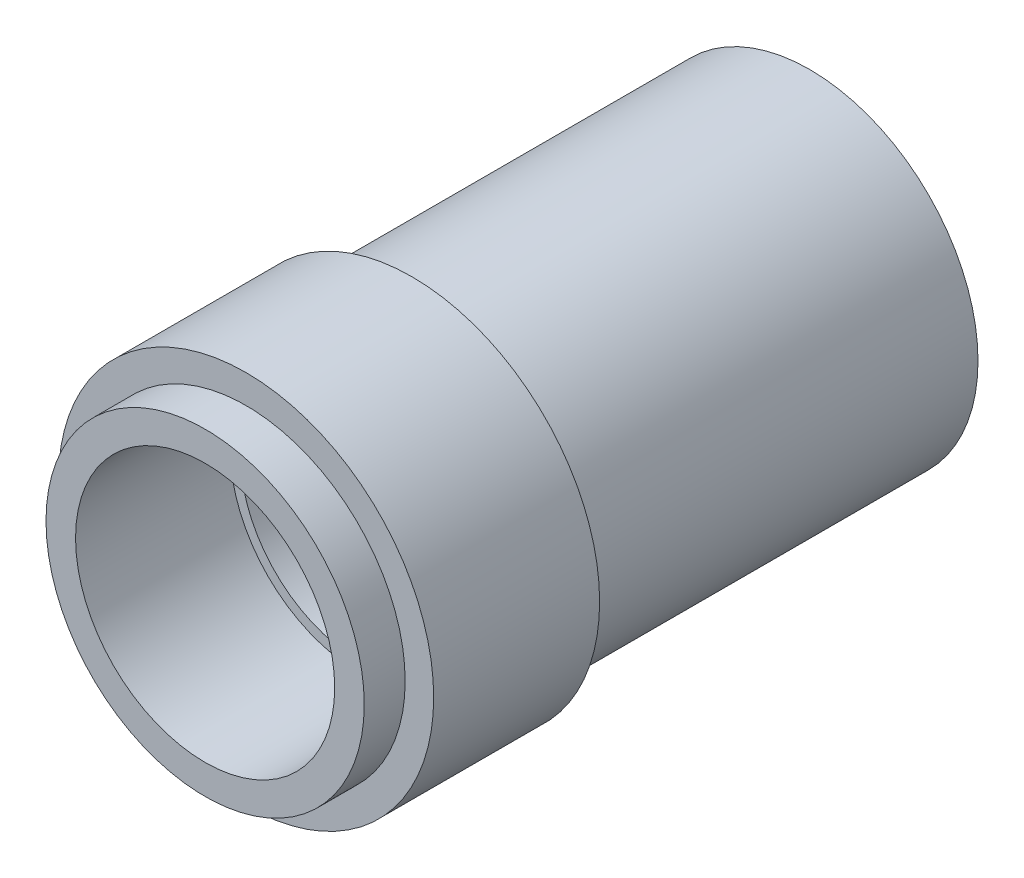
ISO-10303-21;
HEADER;
FILE_DESCRIPTION(('STEP AP214'),'2;1');
FILE_NAME('part.step','',(''),(''),'','','');
FILE_SCHEMA(('AUTOMOTIVE_DESIGN { 1 0 10303 214 1 1 1 1 }'));
ENDSEC;
DATA;
#1=APPLICATION_CONTEXT('core data for automotive mechanical design processes');
#2=APPLICATION_PROTOCOL_DEFINITION('international standard','automotive_design',2000,#1);
#3=PRODUCT_CONTEXT('',#1,'mechanical');
#4=PRODUCT('Part','Part','',(#3));
#5=PRODUCT_RELATED_PRODUCT_CATEGORY('part','',(#4));
#6=PRODUCT_DEFINITION_FORMATION('','',#4);
#7=PRODUCT_DEFINITION_CONTEXT('part definition',#1,'design');
#8=PRODUCT_DEFINITION('design','',#6,#7);
#9=PRODUCT_DEFINITION_SHAPE('','',#8);
#10=(LENGTH_UNIT() NAMED_UNIT(*) SI_UNIT(.MILLI.,.METRE.));
#11=(NAMED_UNIT(*) PLANE_ANGLE_UNIT() SI_UNIT($,.RADIAN.));
#12=(NAMED_UNIT(*) SI_UNIT($,.STERADIAN.) SOLID_ANGLE_UNIT());
#13=UNCERTAINTY_MEASURE_WITH_UNIT(LENGTH_MEASURE(1.E-05),#10,'distance_accuracy_value','');
#14=(GEOMETRIC_REPRESENTATION_CONTEXT(3) GLOBAL_UNCERTAINTY_ASSIGNED_CONTEXT((#13)) GLOBAL_UNIT_ASSIGNED_CONTEXT((#10,
#11,#12)) REPRESENTATION_CONTEXT('',''));
#15=CARTESIAN_POINT('',(0.,0.,0.));
#16=DIRECTION('',(0.,0.,1.));
#17=DIRECTION('',(1.,0.,0.));
#18=AXIS2_PLACEMENT_3D('',#15,#16,#17);
#19=CARTESIAN_POINT('',(59.8499961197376,59.8499961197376,198.));
#20=DIRECTION('',(0.,0.,1.));
#21=DIRECTION('',(-1.,0.,0.));
#22=AXIS2_PLACEMENT_3D('',#19,#20,#21);
#23=PLANE('',#22);
#24=CARTESIAN_POINT('',(-1.12776293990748E-13,0.,198.));
#25=DIRECTION('',(0.,0.,1.));
#26=DIRECTION('',(1.,0.,0.));
#27=AXIS2_PLACEMENT_3D('',#24,#25,#26);
#28=CIRCLE('',#27,52.5);
#29=CARTESIAN_POINT('',(0.,-52.5,198.));
#30=VERTEX_POINT('',#29);
#31=EDGE_CURVE('E18',#30,#30,#28,.T.);
#32=ORIENTED_EDGE('',*,*,#31,.F.);
#33=EDGE_LOOP('',(#32));
#34=FACE_BOUND('',#33,.T.);
#35=CARTESIAN_POINT('',(0.,0.,198.));
#36=DIRECTION('',(0.,0.,1.));
#37=DIRECTION('',(1.,0.,0.));
#38=AXIS2_PLACEMENT_3D('',#35,#36,#37);
#39=CIRCLE('',#38,57.);
#40=CARTESIAN_POINT('',(0.,-57.,198.));
#41=VERTEX_POINT('',#40);
#42=EDGE_CURVE('E9',#41,#41,#39,.T.);
#43=ORIENTED_EDGE('',*,*,#42,.T.);
#44=EDGE_LOOP('',(#43));
#45=FACE_BOUND('',#44,.T.);
#46=ADVANCED_FACE('F14',(#34,#45),#23,.T.);
#47=CARTESIAN_POINT('',(0.,0.,266.));
#48=DIRECTION('',(0.,0.,-1.));
#49=DIRECTION('',(-1.,0.,0.));
#50=AXIS2_PLACEMENT_3D('',#47,#48,#49);
#51=CYLINDRICAL_SURFACE('',#50,57.);
#52=CARTESIAN_POINT('',(0.,0.,266.));
#53=DIRECTION('',(0.,0.,-1.));
#54=DIRECTION('',(-1.,0.,0.));
#55=AXIS2_PLACEMENT_3D('',#52,#53,#54);
#56=CIRCLE('',#55,57.);
#57=CARTESIAN_POINT('',(0.,-57.,266.));
#58=VERTEX_POINT('',#57);
#59=EDGE_CURVE('E134',#58,#58,#56,.T.);
#60=ORIENTED_EDGE('',*,*,#59,.F.);
#61=DIRECTION('',(0.,0.,-1.));
#62=VECTOR('',#61,1.);
#63=CARTESIAN_POINT('',(0.,-57.,232.));
#64=LINE('',#63,#62);
#65=EDGE_CURVE('E24',#58,#41,#64,.T.);
#66=ORIENTED_EDGE('',*,*,#65,.T.);
#67=ORIENTED_EDGE('',*,*,#42,.F.);
#68=ORIENTED_EDGE('',*,*,#65,.F.);
#69=EDGE_LOOP('',(#60,#66,#67,#68));
#70=FACE_BOUND('',#69,.T.);
#71=ADVANCED_FACE('F108',(#70),#51,.F.);
#72=CARTESIAN_POINT('',(-73.4999999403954,73.4999999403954,266.));
#73=DIRECTION('',(0.,0.,1.));
#74=DIRECTION('',(0.,-1.,0.));
#75=AXIS2_PLACEMENT_3D('',#72,#73,#74);
#76=PLANE('',#75);
#77=ORIENTED_EDGE('',*,*,#59,.T.);
#78=EDGE_LOOP('',(#77));
#79=FACE_BOUND('',#78,.T.);
#80=CARTESIAN_POINT('',(0.,0.,266.));
#81=DIRECTION('',(0.,0.,-1.));
#82=DIRECTION('',(0.,1.,0.));
#83=AXIS2_PLACEMENT_3D('',#80,#81,#82);
#84=CIRCLE('',#83,70.);
#85=CARTESIAN_POINT('',(-70.0000000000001,0.,266.));
#86=VERTEX_POINT('',#85);
#87=EDGE_CURVE('E133',#86,#86,#84,.T.);
#88=ORIENTED_EDGE('',*,*,#87,.F.);
#89=EDGE_LOOP('',(#88));
#90=FACE_BOUND('',#89,.T.);
#91=ADVANCED_FACE('F113',(#79,#90),#76,.T.);
#92=CARTESIAN_POINT('',(0.,0.,248.));
#93=DIRECTION('',(0.,0.,1.));
#94=DIRECTION('',(1.,0.,0.));
#95=AXIS2_PLACEMENT_3D('',#92,#93,#94);
#96=CYLINDRICAL_SURFACE('',#95,70.);
#97=CARTESIAN_POINT('',(0.,0.,248.));
#98=DIRECTION('',(0.,0.,-1.));
#99=DIRECTION('',(-1.,0.,0.));
#100=AXIS2_PLACEMENT_3D('',#97,#98,#99);
#101=CIRCLE('',#100,70.);
#102=CARTESIAN_POINT('',(-70.0000000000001,0.,248.));
#103=VERTEX_POINT('',#102);
#104=EDGE_CURVE('E63',#103,#103,#101,.T.);
#105=ORIENTED_EDGE('',*,*,#104,.F.);
#106=DIRECTION('',(0.,0.,-1.));
#107=VECTOR('',#106,1.);
#108=CARTESIAN_POINT('',(-70.0000000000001,0.,257.));
#109=LINE('',#108,#107);
#110=EDGE_CURVE('E67',#86,#103,#109,.T.);
#111=ORIENTED_EDGE('',*,*,#110,.F.);
#112=ORIENTED_EDGE('',*,*,#87,.T.);
#113=ORIENTED_EDGE('',*,*,#110,.T.);
#114=EDGE_LOOP('',(#105,#111,#112,#113));
#115=FACE_BOUND('',#114,.T.);
#116=ADVANCED_FACE('F120',(#115),#96,.T.);
#117=CARTESIAN_POINT('',(86.6774916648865,86.6774916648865,248.));
#118=DIRECTION('',(0.,0.,1.));
#119=DIRECTION('',(-1.,0.,0.));
#120=AXIS2_PLACEMENT_3D('',#117,#118,#119);
#121=PLANE('',#120);
#122=ORIENTED_EDGE('',*,*,#104,.T.);
#123=EDGE_LOOP('',(#122));
#124=FACE_BOUND('',#123,.T.);
#125=CARTESIAN_POINT('',(0.,1.35308431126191E-13,248.));
#126=DIRECTION('',(0.,0.,-1.));
#127=DIRECTION('',(-1.,0.,0.));
#128=AXIS2_PLACEMENT_3D('',#125,#126,#127);
#129=CIRCLE('',#128,82.55);
#130=CARTESIAN_POINT('',(0.,82.5500000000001,248.));
#131=VERTEX_POINT('',#130);
#132=EDGE_CURVE('E64',#131,#131,#129,.T.);
#133=ORIENTED_EDGE('',*,*,#132,.F.);
#134=EDGE_LOOP('',(#133));
#135=FACE_BOUND('',#134,.T.);
#136=ADVANCED_FACE('F105',(#124,#135),#121,.T.);
#137=CARTESIAN_POINT('',(0.,0.,175.));
#138=DIRECTION('',(0.,0.,1.));
#139=DIRECTION('',(1.,0.,0.));
#140=AXIS2_PLACEMENT_3D('',#137,#138,#139);
#141=CYLINDRICAL_SURFACE('',#140,82.55);
#142=CARTESIAN_POINT('',(0.,0.,175.));
#143=DIRECTION('',(0.,0.,1.));
#144=DIRECTION('',(1.,0.,0.));
#145=AXIS2_PLACEMENT_3D('',#142,#143,#144);
#146=CIRCLE('',#145,82.55);
#147=CARTESIAN_POINT('',(0.,82.5500000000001,175.));
#148=VERTEX_POINT('',#147);
#149=EDGE_CURVE('E61',#148,#148,#146,.T.);
#150=ORIENTED_EDGE('',*,*,#149,.T.);
#151=DIRECTION('',(0.,0.,-1.));
#152=VECTOR('',#151,1.);
#153=CARTESIAN_POINT('',(0.,82.5500000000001,211.5));
#154=LINE('',#153,#152);
#155=EDGE_CURVE('E56',#131,#148,#154,.T.);
#156=ORIENTED_EDGE('',*,*,#155,.F.);
#157=ORIENTED_EDGE('',*,*,#132,.T.);
#158=ORIENTED_EDGE('',*,*,#155,.T.);
#159=EDGE_LOOP('',(#150,#156,#157,#158));
#160=FACE_BOUND('',#159,.T.);
#161=ADVANCED_FACE('F97',(#160),#141,.T.);
#162=CARTESIAN_POINT('',(-86.6774916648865,-86.6774916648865,175.));
#163=DIRECTION('',(0.,0.,-1.));
#164=DIRECTION('',(0.,1.,0.));
#165=AXIS2_PLACEMENT_3D('',#162,#163,#164);
#166=PLANE('',#165);
#167=CARTESIAN_POINT('',(0.,0.,175.));
#168=DIRECTION('',(0.,0.,-1.));
#169=DIRECTION('',(-1.,0.,0.));
#170=AXIS2_PLACEMENT_3D('',#167,#168,#169);
#171=CIRCLE('',#170,74.);
#172=CARTESIAN_POINT('',(74.,0.,175.));
#173=VERTEX_POINT('',#172);
#174=EDGE_CURVE('E76',#173,#173,#171,.T.);
#175=ORIENTED_EDGE('',*,*,#174,.F.);
#176=EDGE_LOOP('',(#175));
#177=FACE_BOUND('',#176,.T.);
#178=ORIENTED_EDGE('',*,*,#149,.F.);
#179=EDGE_LOOP('',(#178));
#180=FACE_BOUND('',#179,.T.);
#181=ADVANCED_FACE('F62',(#177,#180),#166,.T.);
#182=CARTESIAN_POINT('',(0.,0.,0.));
#183=DIRECTION('',(0.,0.,1.));
#184=DIRECTION('',(1.,0.,0.));
#185=AXIS2_PLACEMENT_3D('',#182,#183,#184);
#186=CYLINDRICAL_SURFACE('',#185,74.);
#187=CARTESIAN_POINT('',(0.,0.,0.));
#188=DIRECTION('',(0.,0.,1.));
#189=DIRECTION('',(1.,0.,0.));
#190=AXIS2_PLACEMENT_3D('',#187,#188,#189);
#191=CIRCLE('',#190,74.);
#192=CARTESIAN_POINT('',(74.,0.,0.));
#193=VERTEX_POINT('',#192);
#194=EDGE_CURVE('E73',#193,#193,#191,.T.);
#195=ORIENTED_EDGE('',*,*,#194,.T.);
#196=DIRECTION('',(0.,0.,-1.));
#197=VECTOR('',#196,1.);
#198=CARTESIAN_POINT('',(74.,0.,87.5));
#199=LINE('',#198,#197);
#200=EDGE_CURVE('E79',#173,#193,#199,.T.);
#201=ORIENTED_EDGE('',*,*,#200,.F.);
#202=ORIENTED_EDGE('',*,*,#174,.T.);
#203=ORIENTED_EDGE('',*,*,#200,.T.);
#204=EDGE_LOOP('',(#195,#201,#202,#203));
#205=FACE_BOUND('',#204,.T.);
#206=ADVANCED_FACE('F92',(#205),#186,.T.);
#207=CARTESIAN_POINT('',(-77.6999965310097,77.6999965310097,0.));
#208=DIRECTION('',(0.,0.,-1.));
#209=DIRECTION('',(1.,0.,0.));
#210=AXIS2_PLACEMENT_3D('',#207,#208,#209);
#211=PLANE('',#210);
#212=CARTESIAN_POINT('',(-1.22522450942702E-13,0.,0.));
#213=DIRECTION('',(0.,0.,1.));
#214=DIRECTION('',(1.,0.,0.));
#215=AXIS2_PLACEMENT_3D('',#212,#213,#214);
#216=CIRCLE('',#215,52.5);
#217=CARTESIAN_POINT('',(0.,-52.5,0.));
#218=VERTEX_POINT('',#217);
#219=EDGE_CURVE('E82',#218,#218,#216,.T.);
#220=ORIENTED_EDGE('',*,*,#219,.T.);
#221=EDGE_LOOP('',(#220));
#222=FACE_BOUND('',#221,.T.);
#223=ORIENTED_EDGE('',*,*,#194,.F.);
#224=EDGE_LOOP('',(#223));
#225=FACE_BOUND('',#224,.T.);
#226=ADVANCED_FACE('F89',(#222,#225),#211,.T.);
#227=CARTESIAN_POINT('',(0.,0.,198.));
#228=DIRECTION('',(0.,0.,-1.));
#229=DIRECTION('',(-1.,0.,0.));
#230=AXIS2_PLACEMENT_3D('',#227,#228,#229);
#231=CYLINDRICAL_SURFACE('',#230,52.5);
#232=ORIENTED_EDGE('',*,*,#219,.F.);
#233=DIRECTION('',(0.,0.,1.));
#234=VECTOR('',#233,1.);
#235=CARTESIAN_POINT('',(0.,-52.5,99.));
#236=LINE('',#235,#234);
#237=EDGE_CURVE('E84',#218,#30,#236,.T.);
#238=ORIENTED_EDGE('',*,*,#237,.T.);
#239=ORIENTED_EDGE('',*,*,#31,.T.);
#240=ORIENTED_EDGE('',*,*,#237,.F.);
#241=EDGE_LOOP('',(#232,#238,#239,#240));
#242=FACE_BOUND('',#241,.T.);
#243=ADVANCED_FACE('F16',(#242),#231,.F.);
#244=CLOSED_SHELL('',(#46,#71,#91,#116,#136,#161,#181,#206,#226,#243));
#245=MANIFOLD_SOLID_BREP('B1',#244);
#246=ADVANCED_BREP_SHAPE_REPRESENTATION('',(#18,#245),#14);
#247=SHAPE_DEFINITION_REPRESENTATION(#9,#246);
ENDSEC;
END-ISO-10303-21;
